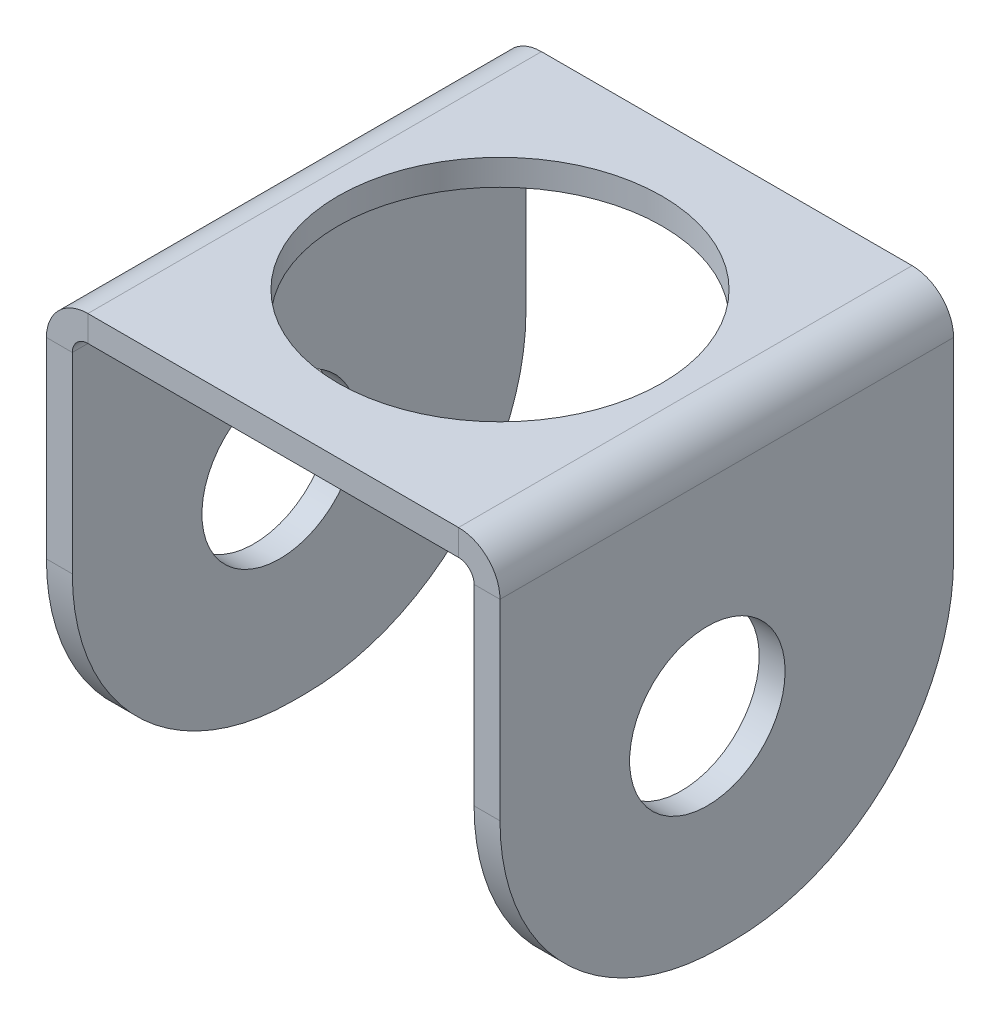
ISO-10303-21;
HEADER;
FILE_DESCRIPTION(('STEP AP214'),'2;1');
FILE_NAME('part.step','',(''),(''),'','','');
FILE_SCHEMA(('AUTOMOTIVE_DESIGN { 1 0 10303 214 1 1 1 1 }'));
ENDSEC;
DATA;
#1=APPLICATION_CONTEXT('core data for automotive mechanical design processes');
#2=APPLICATION_PROTOCOL_DEFINITION('international standard','automotive_design',2000,#1);
#3=PRODUCT_CONTEXT('',#1,'mechanical');
#4=PRODUCT('Part','Part','',(#3));
#5=PRODUCT_RELATED_PRODUCT_CATEGORY('part','',(#4));
#6=PRODUCT_DEFINITION_FORMATION('','',#4);
#7=PRODUCT_DEFINITION_CONTEXT('part definition',#1,'design');
#8=PRODUCT_DEFINITION('design','',#6,#7);
#9=PRODUCT_DEFINITION_SHAPE('','',#8);
#10=(LENGTH_UNIT() NAMED_UNIT(*) SI_UNIT(.MILLI.,.METRE.));
#11=(NAMED_UNIT(*) PLANE_ANGLE_UNIT() SI_UNIT($,.RADIAN.));
#12=(NAMED_UNIT(*) SI_UNIT($,.STERADIAN.) SOLID_ANGLE_UNIT());
#13=UNCERTAINTY_MEASURE_WITH_UNIT(LENGTH_MEASURE(1.E-05),#10,'distance_accuracy_value','');
#14=(GEOMETRIC_REPRESENTATION_CONTEXT(3) GLOBAL_UNCERTAINTY_ASSIGNED_CONTEXT((#13)) GLOBAL_UNIT_ASSIGNED_CONTEXT((#10,
#11,#12)) REPRESENTATION_CONTEXT('',''));
#15=CARTESIAN_POINT('',(0.,0.,0.));
#16=DIRECTION('',(0.,0.,1.));
#17=DIRECTION('',(1.,0.,0.));
#18=AXIS2_PLACEMENT_3D('',#15,#16,#17);
#19=CARTESIAN_POINT('',(-17.5,-35.,17.5));
#20=DIRECTION('',(-1.,0.,0.));
#21=DIRECTION('',(0.,-1.,0.));
#22=AXIS2_PLACEMENT_3D('',#19,#20,#21);
#23=PLANE('',#22);
#24=DIRECTION('',(0.,0.,1.));
#25=VECTOR('',#24,1.);
#26=CARTESIAN_POINT('',(-17.5,-3.2,17.5));
#27=LINE('',#26,#25);
#28=CARTESIAN_POINT('',(-17.5,-3.20000000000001,-17.5));
#29=VERTEX_POINT('',#28);
#30=CARTESIAN_POINT('',(-17.5,-3.2,17.5));
#31=VERTEX_POINT('',#30);
#32=EDGE_CURVE('E231',#29,#31,#27,.T.);
#33=ORIENTED_EDGE('',*,*,#32,.F.);
#34=DIRECTION('',(0.,1.,0.));
#35=VECTOR('',#34,1.);
#36=CARTESIAN_POINT('',(-17.5,-35.,-17.5));
#37=LINE('',#36,#35);
#38=CARTESIAN_POINT('',(-17.5,-18.,-17.5));
#39=VERTEX_POINT('',#38);
#40=EDGE_CURVE('E223',#39,#29,#37,.T.);
#41=ORIENTED_EDGE('',*,*,#40,.F.);
#42=CARTESIAN_POINT('',(-17.5,-18.,-0.5));
#43=DIRECTION('',(-1.,0.,0.));
#44=DIRECTION('',(0.,-1.,0.));
#45=AXIS2_PLACEMENT_3D('',#42,#43,#44);
#46=CIRCLE('',#45,17.);
#47=CARTESIAN_POINT('',(-17.5,-35.,-0.5));
#48=VERTEX_POINT('',#47);
#49=EDGE_CURVE('E226',#39,#48,#46,.T.);
#50=ORIENTED_EDGE('',*,*,#49,.T.);
#51=DIRECTION('',(0.,0.,-1.));
#52=VECTOR('',#51,1.);
#53=CARTESIAN_POINT('',(-17.5,-35.,17.5));
#54=LINE('',#53,#52);
#55=CARTESIAN_POINT('',(-17.5,-35.,0.5));
#56=VERTEX_POINT('',#55);
#57=EDGE_CURVE('E219',#56,#48,#54,.T.);
#58=ORIENTED_EDGE('',*,*,#57,.F.);
#59=CARTESIAN_POINT('',(-17.5,-18.,0.5));
#60=DIRECTION('',(-1.,0.,0.));
#61=DIRECTION('',(0.,-1.,0.));
#62=AXIS2_PLACEMENT_3D('',#59,#60,#61);
#63=CIRCLE('',#62,17.);
#64=CARTESIAN_POINT('',(-17.5,-18.,17.5));
#65=VERTEX_POINT('',#64);
#66=EDGE_CURVE('E49',#56,#65,#63,.T.);
#67=ORIENTED_EDGE('',*,*,#66,.T.);
#68=DIRECTION('',(0.,1.,0.));
#69=VECTOR('',#68,1.);
#70=CARTESIAN_POINT('',(-17.5,-35.,17.5));
#71=LINE('',#70,#69);
#72=EDGE_CURVE('E42',#65,#31,#71,.T.);
#73=ORIENTED_EDGE('',*,*,#72,.T.);
#74=EDGE_LOOP('',(#33,#41,#50,#58,#67,#73));
#75=FACE_BOUND('',#74,.T.);
#76=CARTESIAN_POINT('',(-17.5,-19.,1.5));
#77=DIRECTION('',(1.,0.,0.));
#78=DIRECTION('',(0.,0.,-1.));
#79=AXIS2_PLACEMENT_3D('',#76,#77,#78);
#80=CIRCLE('',#79,6.);
#81=CARTESIAN_POINT('',(-17.5,-19.,-4.5));
#82=VERTEX_POINT('',#81);
#83=EDGE_CURVE('E216',#82,#82,#80,.T.);
#84=ORIENTED_EDGE('',*,*,#83,.T.);
#85=EDGE_LOOP('',(#84));
#86=FACE_BOUND('',#85,.T.);
#87=ADVANCED_FACE('F28',(#75,#86),#23,.T.);
#88=CARTESIAN_POINT('',(-17.5,-19.,1.5));
#89=DIRECTION('',(1.,0.,0.));
#90=DIRECTION('',(0.,0.,-1.));
#91=AXIS2_PLACEMENT_3D('',#88,#89,#90);
#92=CYLINDRICAL_SURFACE('',#91,6.);
#93=ORIENTED_EDGE('',*,*,#83,.F.);
#94=EDGE_LOOP('',(#93));
#95=FACE_BOUND('',#94,.T.);
#96=CARTESIAN_POINT('',(-15.5,-19.,1.5));
#97=DIRECTION('',(-1.,0.,0.));
#98=DIRECTION('',(0.,-1.,0.));
#99=AXIS2_PLACEMENT_3D('',#96,#97,#98);
#100=CIRCLE('',#99,6.);
#101=CARTESIAN_POINT('',(-15.5,-25.,1.5));
#102=VERTEX_POINT('',#101);
#103=EDGE_CURVE('E201',#102,#102,#100,.T.);
#104=ORIENTED_EDGE('',*,*,#103,.F.);
#105=EDGE_LOOP('',(#104));
#106=FACE_BOUND('',#105,.T.);
#107=ADVANCED_FACE('F359',(#95,#106),#92,.F.);
#108=CARTESIAN_POINT('',(-15.5,-35.,17.5));
#109=DIRECTION('',(-1.,0.,0.));
#110=DIRECTION('',(0.,-1.,0.));
#111=AXIS2_PLACEMENT_3D('',#108,#109,#110);
#112=PLANE('',#111);
#113=ORIENTED_EDGE('',*,*,#103,.T.);
#114=EDGE_LOOP('',(#113));
#115=FACE_BOUND('',#114,.T.);
#116=DIRECTION('',(0.,1.,0.));
#117=VECTOR('',#116,1.);
#118=CARTESIAN_POINT('',(-15.5,-35.,-17.5));
#119=LINE('',#118,#117);
#120=CARTESIAN_POINT('',(-15.5,-18.,-17.5));
#121=VERTEX_POINT('',#120);
#122=CARTESIAN_POINT('',(-15.5,-3.2,-17.5));
#123=VERTEX_POINT('',#122);
#124=EDGE_CURVE('E213',#121,#123,#119,.T.);
#125=ORIENTED_EDGE('',*,*,#124,.T.);
#126=DIRECTION('',(0.,0.,1.));
#127=VECTOR('',#126,1.);
#128=CARTESIAN_POINT('',(-15.5,-3.2,17.5));
#129=LINE('',#128,#127);
#130=CARTESIAN_POINT('',(-15.5,-3.19999999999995,17.5));
#131=VERTEX_POINT('',#130);
#132=EDGE_CURVE('E229',#123,#131,#129,.T.);
#133=ORIENTED_EDGE('',*,*,#132,.T.);
#134=DIRECTION('',(0.,1.,0.));
#135=VECTOR('',#134,1.);
#136=CARTESIAN_POINT('',(-15.5,-35.,17.5));
#137=LINE('',#136,#135);
#138=CARTESIAN_POINT('',(-15.5,-18.,17.5));
#139=VERTEX_POINT('',#138);
#140=EDGE_CURVE('E204',#139,#131,#137,.T.);
#141=ORIENTED_EDGE('',*,*,#140,.F.);
#142=CARTESIAN_POINT('',(-15.5,-18.,0.5));
#143=DIRECTION('',(-1.,0.,0.));
#144=DIRECTION('',(0.,-1.,0.));
#145=AXIS2_PLACEMENT_3D('',#142,#143,#144);
#146=CIRCLE('',#145,17.);
#147=CARTESIAN_POINT('',(-15.5,-35.,0.5));
#148=VERTEX_POINT('',#147);
#149=EDGE_CURVE('E207',#139,#148,#146,.F.);
#150=ORIENTED_EDGE('',*,*,#149,.T.);
#151=DIRECTION('',(0.,0.,-1.));
#152=VECTOR('',#151,1.);
#153=CARTESIAN_POINT('',(-15.5,-35.,17.5));
#154=LINE('',#153,#152);
#155=CARTESIAN_POINT('',(-15.5,-35.,-0.5));
#156=VERTEX_POINT('',#155);
#157=EDGE_CURVE('E209',#148,#156,#154,.T.);
#158=ORIENTED_EDGE('',*,*,#157,.T.);
#159=CARTESIAN_POINT('',(-15.5,-18.,-0.5));
#160=DIRECTION('',(-1.,0.,0.));
#161=DIRECTION('',(0.,-1.,0.));
#162=AXIS2_PLACEMENT_3D('',#159,#160,#161);
#163=CIRCLE('',#162,17.);
#164=EDGE_CURVE('E211',#156,#121,#163,.F.);
#165=ORIENTED_EDGE('',*,*,#164,.T.);
#166=EDGE_LOOP('',(#125,#133,#141,#150,#158,#165));
#167=FACE_BOUND('',#166,.T.);
#168=ADVANCED_FACE('F260',(#115,#167),#112,.F.);
#169=CARTESIAN_POINT('',(77.0777986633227,-35.,17.5));
#170=DIRECTION('',(0.,0.,1.));
#171=DIRECTION('',(-1.,0.,0.));
#172=AXIS2_PLACEMENT_3D('',#169,#170,#171);
#173=PLANE('',#172);
#174=DIRECTION('',(-1.,0.,0.));
#175=VECTOR('',#174,1.);
#176=CARTESIAN_POINT('',(77.0777986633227,-3.19999999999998,17.5));
#177=LINE('',#176,#175);
#178=EDGE_CURVE('E11',#131,#31,#177,.T.);
#179=ORIENTED_EDGE('',*,*,#178,.T.);
#180=ORIENTED_EDGE('',*,*,#72,.F.);
#181=DIRECTION('',(-1.,0.,0.));
#182=VECTOR('',#181,1.);
#183=CARTESIAN_POINT('',(77.0777986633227,-18.,17.5));
#184=LINE('',#183,#182);
#185=EDGE_CURVE('E36',#139,#65,#184,.T.);
#186=ORIENTED_EDGE('',*,*,#185,.F.);
#187=ORIENTED_EDGE('',*,*,#140,.T.);
#188=EDGE_LOOP('',(#179,#180,#186,#187));
#189=FACE_BOUND('',#188,.T.);
#190=ADVANCED_FACE('F30',(#189),#173,.T.);
#191=CARTESIAN_POINT('',(77.0777986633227,-18.,0.5));
#192=DIRECTION('',(-1.,0.,0.));
#193=DIRECTION('',(0.,-1.,0.));
#194=AXIS2_PLACEMENT_3D('',#191,#192,#193);
#195=CYLINDRICAL_SURFACE('',#194,17.);
#196=ORIENTED_EDGE('',*,*,#66,.F.);
#197=DIRECTION('',(-1.,0.,0.));
#198=VECTOR('',#197,1.);
#199=CARTESIAN_POINT('',(77.0777986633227,-35.,0.5));
#200=LINE('',#199,#198);
#201=EDGE_CURVE('E241',#148,#56,#200,.T.);
#202=ORIENTED_EDGE('',*,*,#201,.F.);
#203=ORIENTED_EDGE('',*,*,#149,.F.);
#204=ORIENTED_EDGE('',*,*,#185,.T.);
#205=EDGE_LOOP('',(#196,#202,#203,#204));
#206=FACE_BOUND('',#205,.T.);
#207=ADVANCED_FACE('F243',(#206),#195,.T.);
#208=CARTESIAN_POINT('',(77.0777986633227,-35.,17.5));
#209=DIRECTION('',(0.,1.,0.));
#210=DIRECTION('',(-1.,0.,0.));
#211=AXIS2_PLACEMENT_3D('',#208,#209,#210);
#212=PLANE('',#211);
#213=ORIENTED_EDGE('',*,*,#57,.T.);
#214=DIRECTION('',(-1.,0.,0.));
#215=VECTOR('',#214,1.);
#216=CARTESIAN_POINT('',(77.0777986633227,-35.,-0.5));
#217=LINE('',#216,#215);
#218=EDGE_CURVE('E238',#156,#48,#217,.T.);
#219=ORIENTED_EDGE('',*,*,#218,.F.);
#220=ORIENTED_EDGE('',*,*,#157,.F.);
#221=ORIENTED_EDGE('',*,*,#201,.T.);
#222=EDGE_LOOP('',(#213,#219,#220,#221));
#223=FACE_BOUND('',#222,.T.);
#224=ADVANCED_FACE('F252',(#223),#212,.F.);
#225=CARTESIAN_POINT('',(77.0777986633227,-18.,-0.5));
#226=DIRECTION('',(-1.,0.,0.));
#227=DIRECTION('',(0.,-1.,0.));
#228=AXIS2_PLACEMENT_3D('',#225,#226,#227);
#229=CYLINDRICAL_SURFACE('',#228,17.);
#230=ORIENTED_EDGE('',*,*,#49,.F.);
#231=DIRECTION('',(-1.,0.,0.));
#232=VECTOR('',#231,1.);
#233=CARTESIAN_POINT('',(77.0777986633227,-18.,-17.5));
#234=LINE('',#233,#232);
#235=EDGE_CURVE('E236',#121,#39,#234,.T.);
#236=ORIENTED_EDGE('',*,*,#235,.F.);
#237=ORIENTED_EDGE('',*,*,#164,.F.);
#238=ORIENTED_EDGE('',*,*,#218,.T.);
#239=EDGE_LOOP('',(#230,#236,#237,#238));
#240=FACE_BOUND('',#239,.T.);
#241=ADVANCED_FACE('F256',(#240),#229,.T.);
#242=CARTESIAN_POINT('',(77.0777986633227,-35.,-17.5));
#243=DIRECTION('',(0.,0.,1.));
#244=DIRECTION('',(-1.,0.,0.));
#245=AXIS2_PLACEMENT_3D('',#242,#243,#244);
#246=PLANE('',#245);
#247=ORIENTED_EDGE('',*,*,#40,.T.);
#248=DIRECTION('',(-1.,0.,0.));
#249=VECTOR('',#248,1.);
#250=CARTESIAN_POINT('',(77.0777986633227,-3.19999999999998,-17.5));
#251=LINE('',#250,#249);
#252=EDGE_CURVE('E234',#123,#29,#251,.T.);
#253=ORIENTED_EDGE('',*,*,#252,.F.);
#254=ORIENTED_EDGE('',*,*,#124,.F.);
#255=ORIENTED_EDGE('',*,*,#235,.T.);
#256=EDGE_LOOP('',(#247,#253,#254,#255));
#257=FACE_BOUND('',#256,.T.);
#258=ADVANCED_FACE('F263',(#257),#246,.F.);
#259=CARTESIAN_POINT('',(-17.5,0.,17.5));
#260=DIRECTION('',(0.,1.,0.));
#261=DIRECTION('',(-1.,0.,0.));
#262=AXIS2_PLACEMENT_3D('',#259,#260,#261);
#263=PLANE('',#262);
#264=CARTESIAN_POINT('',(0.,0.,0.));
#265=DIRECTION('',(0.,1.,0.));
#266=DIRECTION('',(-1.,0.,0.));
#267=AXIS2_PLACEMENT_3D('',#264,#265,#266);
#268=CIRCLE('',#267,12.5);
#269=CARTESIAN_POINT('',(-12.5,0.,0.));
#270=VERTEX_POINT('',#269);
#271=EDGE_CURVE('E177',#270,#270,#268,.T.);
#272=ORIENTED_EDGE('',*,*,#271,.F.);
#273=EDGE_LOOP('',(#272));
#274=FACE_BOUND('',#273,.T.);
#275=DIRECTION('',(1.,0.,0.));
#276=VECTOR('',#275,1.);
#277=CARTESIAN_POINT('',(-17.5,0.,-17.5));
#278=LINE('',#277,#276);
#279=CARTESIAN_POINT('',(-14.3,0.,-17.5));
#280=VERTEX_POINT('',#279);
#281=CARTESIAN_POINT('',(14.3,0.,-17.5));
#282=VERTEX_POINT('',#281);
#283=EDGE_CURVE('E181',#280,#282,#278,.T.);
#284=ORIENTED_EDGE('',*,*,#283,.F.);
#285=DIRECTION('',(0.,0.,1.));
#286=VECTOR('',#285,1.);
#287=CARTESIAN_POINT('',(-14.3,0.,17.5));
#288=LINE('',#287,#286);
#289=CARTESIAN_POINT('',(-14.3,0.,17.5));
#290=VERTEX_POINT('',#289);
#291=EDGE_CURVE('E161',#280,#290,#288,.T.);
#292=ORIENTED_EDGE('',*,*,#291,.T.);
#293=DIRECTION('',(1.,0.,0.));
#294=VECTOR('',#293,1.);
#295=CARTESIAN_POINT('',(-17.5,0.,17.5));
#296=LINE('',#295,#294);
#297=CARTESIAN_POINT('',(14.3,0.,17.5));
#298=VERTEX_POINT('',#297);
#299=EDGE_CURVE('E162',#290,#298,#296,.T.);
#300=ORIENTED_EDGE('',*,*,#299,.T.);
#301=DIRECTION('',(0.,0.,1.));
#302=VECTOR('',#301,1.);
#303=CARTESIAN_POINT('',(14.3,0.,17.5));
#304=LINE('',#303,#302);
#305=EDGE_CURVE('E198',#282,#298,#304,.T.);
#306=ORIENTED_EDGE('',*,*,#305,.F.);
#307=EDGE_LOOP('',(#284,#292,#300,#306));
#308=FACE_BOUND('',#307,.T.);
#309=ADVANCED_FACE('F355',(#274,#308),#263,.T.);
#310=CARTESIAN_POINT('',(-17.5,-2.,17.5));
#311=DIRECTION('',(0.,1.,0.));
#312=DIRECTION('',(-1.,0.,0.));
#313=AXIS2_PLACEMENT_3D('',#310,#311,#312);
#314=PLANE('',#313);
#315=CARTESIAN_POINT('',(0.,-2.,0.));
#316=DIRECTION('',(0.,1.,0.));
#317=DIRECTION('',(-1.,0.,0.));
#318=AXIS2_PLACEMENT_3D('',#315,#316,#317);
#319=CIRCLE('',#318,12.5);
#320=CARTESIAN_POINT('',(-12.5,-2.,0.));
#321=VERTEX_POINT('',#320);
#322=EDGE_CURVE('E183',#321,#321,#319,.T.);
#323=ORIENTED_EDGE('',*,*,#322,.T.);
#324=EDGE_LOOP('',(#323));
#325=FACE_BOUND('',#324,.T.);
#326=DIRECTION('',(0.,0.,1.));
#327=VECTOR('',#326,1.);
#328=CARTESIAN_POINT('',(-14.3,-2.00000000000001,17.5));
#329=LINE('',#328,#327);
#330=CARTESIAN_POINT('',(-14.3,-2.,-17.5));
#331=VERTEX_POINT('',#330);
#332=CARTESIAN_POINT('',(-14.3,-2.,17.5));
#333=VERTEX_POINT('',#332);
#334=EDGE_CURVE('E154',#331,#333,#329,.T.);
#335=ORIENTED_EDGE('',*,*,#334,.F.);
#336=DIRECTION('',(1.,0.,0.));
#337=VECTOR('',#336,1.);
#338=CARTESIAN_POINT('',(-17.5,-2.,-17.5));
#339=LINE('',#338,#337);
#340=CARTESIAN_POINT('',(14.3,-1.99999999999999,-17.5));
#341=VERTEX_POINT('',#340);
#342=EDGE_CURVE('E178',#331,#341,#339,.T.);
#343=ORIENTED_EDGE('',*,*,#342,.T.);
#344=DIRECTION('',(0.,0.,1.));
#345=VECTOR('',#344,1.);
#346=CARTESIAN_POINT('',(14.3,-1.99999999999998,17.5));
#347=LINE('',#346,#345);
#348=CARTESIAN_POINT('',(14.3,-1.99999999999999,17.5));
#349=VERTEX_POINT('',#348);
#350=EDGE_CURVE('E173',#341,#349,#347,.T.);
#351=ORIENTED_EDGE('',*,*,#350,.T.);
#352=DIRECTION('',(1.,0.,0.));
#353=VECTOR('',#352,1.);
#354=CARTESIAN_POINT('',(-17.5,-2.,17.5));
#355=LINE('',#354,#353);
#356=EDGE_CURVE('E169',#333,#349,#355,.T.);
#357=ORIENTED_EDGE('',*,*,#356,.F.);
#358=EDGE_LOOP('',(#335,#343,#351,#357));
#359=FACE_BOUND('',#358,.T.);
#360=ADVANCED_FACE('F176',(#325,#359),#314,.F.);
#361=CARTESIAN_POINT('',(0.,-35.,0.));
#362=DIRECTION('',(0.,1.,0.));
#363=DIRECTION('',(-1.,0.,0.));
#364=AXIS2_PLACEMENT_3D('',#361,#362,#363);
#365=CYLINDRICAL_SURFACE('',#364,12.5);
#366=ORIENTED_EDGE('',*,*,#271,.T.);
#367=EDGE_LOOP('',(#366));
#368=FACE_BOUND('',#367,.T.);
#369=ORIENTED_EDGE('',*,*,#322,.F.);
#370=EDGE_LOOP('',(#369));
#371=FACE_BOUND('',#370,.T.);
#372=ADVANCED_FACE('F345',(#368,#371),#365,.F.);
#373=CARTESIAN_POINT('',(-17.5,-90.398230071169,17.5));
#374=DIRECTION('',(0.,0.,1.));
#375=DIRECTION('',(0.,1.,0.));
#376=AXIS2_PLACEMENT_3D('',#373,#374,#375);
#377=PLANE('',#376);
#378=DIRECTION('',(0.,1.,0.));
#379=VECTOR('',#378,1.);
#380=CARTESIAN_POINT('',(14.3,-90.398230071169,17.5));
#381=LINE('',#380,#379);
#382=EDGE_CURVE('E191',#349,#298,#381,.T.);
#383=ORIENTED_EDGE('',*,*,#382,.T.);
#384=ORIENTED_EDGE('',*,*,#299,.F.);
#385=DIRECTION('',(0.,1.,0.));
#386=VECTOR('',#385,1.);
#387=CARTESIAN_POINT('',(-14.3,-90.398230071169,17.5));
#388=LINE('',#387,#386);
#389=EDGE_CURVE('E146',#333,#290,#388,.T.);
#390=ORIENTED_EDGE('',*,*,#389,.F.);
#391=ORIENTED_EDGE('',*,*,#356,.T.);
#392=EDGE_LOOP('',(#383,#384,#390,#391));
#393=FACE_BOUND('',#392,.T.);
#394=ADVANCED_FACE('F168',(#393),#377,.T.);
#395=CARTESIAN_POINT('',(-17.5,-90.398230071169,-17.5));
#396=DIRECTION('',(0.,0.,1.));
#397=DIRECTION('',(0.,1.,0.));
#398=AXIS2_PLACEMENT_3D('',#395,#396,#397);
#399=PLANE('',#398);
#400=ORIENTED_EDGE('',*,*,#283,.T.);
#401=DIRECTION('',(0.,1.,0.));
#402=VECTOR('',#401,1.);
#403=CARTESIAN_POINT('',(14.3,-90.398230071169,-17.5));
#404=LINE('',#403,#402);
#405=EDGE_CURVE('E193',#341,#282,#404,.T.);
#406=ORIENTED_EDGE('',*,*,#405,.F.);
#407=ORIENTED_EDGE('',*,*,#342,.F.);
#408=DIRECTION('',(0.,1.,0.));
#409=VECTOR('',#408,1.);
#410=CARTESIAN_POINT('',(-14.3,-90.398230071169,-17.5));
#411=LINE('',#410,#409);
#412=EDGE_CURVE('E174',#331,#280,#411,.T.);
#413=ORIENTED_EDGE('',*,*,#412,.T.);
#414=EDGE_LOOP('',(#400,#406,#407,#413));
#415=FACE_BOUND('',#414,.T.);
#416=ADVANCED_FACE('F353',(#415),#399,.F.);
#417=CARTESIAN_POINT('',(17.5,0.,17.5));
#418=DIRECTION('',(1.,0.,0.));
#419=DIRECTION('',(0.,1.,0.));
#420=AXIS2_PLACEMENT_3D('',#417,#418,#419);
#421=PLANE('',#420);
#422=CARTESIAN_POINT('',(17.5,-19.,1.5));
#423=DIRECTION('',(1.,0.,0.));
#424=DIRECTION('',(0.,0.,-1.));
#425=AXIS2_PLACEMENT_3D('',#422,#423,#424);
#426=CIRCLE('',#425,6.);
#427=CARTESIAN_POINT('',(17.5,-19.,-4.5));
#428=VERTEX_POINT('',#427);
#429=EDGE_CURVE('E303',#428,#428,#426,.T.);
#430=ORIENTED_EDGE('',*,*,#429,.F.);
#431=EDGE_LOOP('',(#430));
#432=FACE_BOUND('',#431,.T.);
#433=DIRECTION('',(0.,-1.,0.));
#434=VECTOR('',#433,1.);
#435=CARTESIAN_POINT('',(17.5,0.,-17.5));
#436=LINE('',#435,#434);
#437=CARTESIAN_POINT('',(17.5,-3.19999999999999,-17.5));
#438=VERTEX_POINT('',#437);
#439=CARTESIAN_POINT('',(17.5,-18.,-17.5));
#440=VERTEX_POINT('',#439);
#441=EDGE_CURVE('E318',#438,#440,#436,.T.);
#442=ORIENTED_EDGE('',*,*,#441,.F.);
#443=DIRECTION('',(0.,0.,1.));
#444=VECTOR('',#443,1.);
#445=CARTESIAN_POINT('',(17.5,-3.19999999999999,17.5));
#446=LINE('',#445,#444);
#447=CARTESIAN_POINT('',(17.5,-3.19999999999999,17.5));
#448=VERTEX_POINT('',#447);
#449=EDGE_CURVE('E323',#438,#448,#446,.T.);
#450=ORIENTED_EDGE('',*,*,#449,.T.);
#451=DIRECTION('',(0.,-1.,0.));
#452=VECTOR('',#451,1.);
#453=CARTESIAN_POINT('',(17.5,0.,17.5));
#454=LINE('',#453,#452);
#455=CARTESIAN_POINT('',(17.5,-18.,17.5));
#456=VERTEX_POINT('',#455);
#457=EDGE_CURVE('E306',#448,#456,#454,.T.);
#458=ORIENTED_EDGE('',*,*,#457,.T.);
#459=CARTESIAN_POINT('',(17.5,-18.,0.5));
#460=DIRECTION('',(1.,0.,0.));
#461=DIRECTION('',(0.,1.,0.));
#462=AXIS2_PLACEMENT_3D('',#459,#460,#461);
#463=CIRCLE('',#462,17.);
#464=CARTESIAN_POINT('',(17.5,-35.,0.5));
#465=VERTEX_POINT('',#464);
#466=EDGE_CURVE('E309',#456,#465,#463,.T.);
#467=ORIENTED_EDGE('',*,*,#466,.T.);
#468=DIRECTION('',(0.,0.,-1.));
#469=VECTOR('',#468,1.);
#470=CARTESIAN_POINT('',(17.5,-35.,17.5));
#471=LINE('',#470,#469);
#472=CARTESIAN_POINT('',(17.5,-35.,-0.5));
#473=VERTEX_POINT('',#472);
#474=EDGE_CURVE('E312',#465,#473,#471,.T.);
#475=ORIENTED_EDGE('',*,*,#474,.T.);
#476=CARTESIAN_POINT('',(17.5,-18.,-0.5));
#477=DIRECTION('',(1.,0.,0.));
#478=DIRECTION('',(0.,1.,0.));
#479=AXIS2_PLACEMENT_3D('',#476,#477,#478);
#480=CIRCLE('',#479,17.);
#481=EDGE_CURVE('E315',#473,#440,#480,.T.);
#482=ORIENTED_EDGE('',*,*,#481,.T.);
#483=EDGE_LOOP('',(#442,#450,#458,#467,#475,#482));
#484=FACE_BOUND('',#483,.T.);
#485=ADVANCED_FACE('F418',(#432,#484),#421,.T.);
#486=CARTESIAN_POINT('',(15.5,0.,17.5));
#487=DIRECTION('',(1.,0.,0.));
#488=DIRECTION('',(0.,1.,0.));
#489=AXIS2_PLACEMENT_3D('',#486,#487,#488);
#490=PLANE('',#489);
#491=CARTESIAN_POINT('',(15.5,-19.,1.5));
#492=DIRECTION('',(1.,0.,0.));
#493=DIRECTION('',(0.,1.,0.));
#494=AXIS2_PLACEMENT_3D('',#491,#492,#493);
#495=CIRCLE('',#494,6.);
#496=CARTESIAN_POINT('',(15.5,-13.,1.5));
#497=VERTEX_POINT('',#496);
#498=EDGE_CURVE('E288',#497,#497,#495,.T.);
#499=ORIENTED_EDGE('',*,*,#498,.T.);
#500=EDGE_LOOP('',(#499));
#501=FACE_BOUND('',#500,.T.);
#502=DIRECTION('',(0.,0.,1.));
#503=VECTOR('',#502,1.);
#504=CARTESIAN_POINT('',(15.5,-3.19999999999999,17.5));
#505=LINE('',#504,#503);
#506=CARTESIAN_POINT('',(15.5,-3.19999999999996,-17.5));
#507=VERTEX_POINT('',#506);
#508=CARTESIAN_POINT('',(15.5,-3.19999999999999,17.5));
#509=VERTEX_POINT('',#508);
#510=EDGE_CURVE('E320',#507,#509,#505,.T.);
#511=ORIENTED_EDGE('',*,*,#510,.F.);
#512=DIRECTION('',(0.,-1.,0.));
#513=VECTOR('',#512,1.);
#514=CARTESIAN_POINT('',(15.5,0.,-17.5));
#515=LINE('',#514,#513);
#516=CARTESIAN_POINT('',(15.5,-18.,-17.5));
#517=VERTEX_POINT('',#516);
#518=EDGE_CURVE('E299',#507,#517,#515,.T.);
#519=ORIENTED_EDGE('',*,*,#518,.T.);
#520=CARTESIAN_POINT('',(15.5,-18.,-0.5));
#521=DIRECTION('',(1.,0.,0.));
#522=DIRECTION('',(0.,1.,0.));
#523=AXIS2_PLACEMENT_3D('',#520,#521,#522);
#524=CIRCLE('',#523,17.);
#525=CARTESIAN_POINT('',(15.5,-35.,-0.5));
#526=VERTEX_POINT('',#525);
#527=EDGE_CURVE('E301',#517,#526,#524,.F.);
#528=ORIENTED_EDGE('',*,*,#527,.T.);
#529=DIRECTION('',(0.,0.,-1.));
#530=VECTOR('',#529,1.);
#531=CARTESIAN_POINT('',(15.5,-35.,17.5));
#532=LINE('',#531,#530);
#533=CARTESIAN_POINT('',(15.5,-35.,0.5));
#534=VERTEX_POINT('',#533);
#535=EDGE_CURVE('E291',#534,#526,#532,.T.);
#536=ORIENTED_EDGE('',*,*,#535,.F.);
#537=CARTESIAN_POINT('',(15.5,-18.,0.5));
#538=DIRECTION('',(1.,0.,0.));
#539=DIRECTION('',(0.,1.,0.));
#540=AXIS2_PLACEMENT_3D('',#537,#538,#539);
#541=CIRCLE('',#540,17.);
#542=CARTESIAN_POINT('',(15.5,-18.,17.5));
#543=VERTEX_POINT('',#542);
#544=EDGE_CURVE('E294',#534,#543,#541,.F.);
#545=ORIENTED_EDGE('',*,*,#544,.T.);
#546=DIRECTION('',(0.,-1.,0.));
#547=VECTOR('',#546,1.);
#548=CARTESIAN_POINT('',(15.5,0.,17.5));
#549=LINE('',#548,#547);
#550=EDGE_CURVE('E296',#509,#543,#549,.T.);
#551=ORIENTED_EDGE('',*,*,#550,.F.);
#552=EDGE_LOOP('',(#511,#519,#528,#536,#545,#551));
#553=FACE_BOUND('',#552,.T.);
#554=ADVANCED_FACE('F425',(#501,#553),#490,.F.);
#555=CARTESIAN_POINT('',(-17.5,-19.,1.5));
#556=DIRECTION('',(1.,0.,0.));
#557=DIRECTION('',(0.,0.,-1.));
#558=AXIS2_PLACEMENT_3D('',#555,#556,#557);
#559=CYLINDRICAL_SURFACE('',#558,6.);
#560=ORIENTED_EDGE('',*,*,#429,.T.);
#561=EDGE_LOOP('',(#560));
#562=FACE_BOUND('',#561,.T.);
#563=ORIENTED_EDGE('',*,*,#498,.F.);
#564=EDGE_LOOP('',(#563));
#565=FACE_BOUND('',#564,.T.);
#566=ADVANCED_FACE('F433',(#562,#565),#559,.F.);
#567=CARTESIAN_POINT('',(-77.0777986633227,0.,17.5));
#568=DIRECTION('',(0.,0.,1.));
#569=DIRECTION('',(1.,0.,0.));
#570=AXIS2_PLACEMENT_3D('',#567,#568,#569);
#571=PLANE('',#570);
#572=DIRECTION('',(1.,0.,0.));
#573=VECTOR('',#572,1.);
#574=CARTESIAN_POINT('',(-77.0777986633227,-18.,17.5));
#575=LINE('',#574,#573);
#576=EDGE_CURVE('E326',#543,#456,#575,.T.);
#577=ORIENTED_EDGE('',*,*,#576,.T.);
#578=ORIENTED_EDGE('',*,*,#457,.F.);
#579=DIRECTION('',(1.,0.,0.));
#580=VECTOR('',#579,1.);
#581=CARTESIAN_POINT('',(-77.0777986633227,-3.20000000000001,17.5));
#582=LINE('',#581,#580);
#583=EDGE_CURVE('E340',#509,#448,#582,.T.);
#584=ORIENTED_EDGE('',*,*,#583,.F.);
#585=ORIENTED_EDGE('',*,*,#550,.T.);
#586=EDGE_LOOP('',(#577,#578,#584,#585));
#587=FACE_BOUND('',#586,.T.);
#588=ADVANCED_FACE('F441',(#587),#571,.T.);
#589=CARTESIAN_POINT('',(-77.0777986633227,0.,-17.5));
#590=DIRECTION('',(0.,0.,1.));
#591=DIRECTION('',(1.,0.,0.));
#592=AXIS2_PLACEMENT_3D('',#589,#590,#591);
#593=PLANE('',#592);
#594=ORIENTED_EDGE('',*,*,#441,.T.);
#595=DIRECTION('',(1.,0.,0.));
#596=VECTOR('',#595,1.);
#597=CARTESIAN_POINT('',(-77.0777986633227,-18.,-17.5));
#598=LINE('',#597,#596);
#599=EDGE_CURVE('E334',#517,#440,#598,.T.);
#600=ORIENTED_EDGE('',*,*,#599,.F.);
#601=ORIENTED_EDGE('',*,*,#518,.F.);
#602=DIRECTION('',(1.,0.,0.));
#603=VECTOR('',#602,1.);
#604=CARTESIAN_POINT('',(-77.0777986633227,-3.20000000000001,-17.5));
#605=LINE('',#604,#603);
#606=EDGE_CURVE('E337',#507,#438,#605,.T.);
#607=ORIENTED_EDGE('',*,*,#606,.T.);
#608=EDGE_LOOP('',(#594,#600,#601,#607));
#609=FACE_BOUND('',#608,.T.);
#610=ADVANCED_FACE('F449',(#609),#593,.F.);
#611=CARTESIAN_POINT('',(-77.0777986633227,-18.,-0.5));
#612=DIRECTION('',(1.,0.,0.));
#613=DIRECTION('',(0.,1.,0.));
#614=AXIS2_PLACEMENT_3D('',#611,#612,#613);
#615=CYLINDRICAL_SURFACE('',#614,17.);
#616=ORIENTED_EDGE('',*,*,#481,.F.);
#617=DIRECTION('',(1.,0.,0.));
#618=VECTOR('',#617,1.);
#619=CARTESIAN_POINT('',(-77.0777986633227,-35.,-0.5));
#620=LINE('',#619,#618);
#621=EDGE_CURVE('E331',#526,#473,#620,.T.);
#622=ORIENTED_EDGE('',*,*,#621,.F.);
#623=ORIENTED_EDGE('',*,*,#527,.F.);
#624=ORIENTED_EDGE('',*,*,#599,.T.);
#625=EDGE_LOOP('',(#616,#622,#623,#624));
#626=FACE_BOUND('',#625,.T.);
#627=ADVANCED_FACE('F457',(#626),#615,.T.);
#628=CARTESIAN_POINT('',(-77.0777986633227,-35.,17.5));
#629=DIRECTION('',(0.,-1.,0.));
#630=DIRECTION('',(1.,0.,0.));
#631=AXIS2_PLACEMENT_3D('',#628,#629,#630);
#632=PLANE('',#631);
#633=ORIENTED_EDGE('',*,*,#621,.T.);
#634=ORIENTED_EDGE('',*,*,#474,.F.);
#635=DIRECTION('',(1.,0.,0.));
#636=VECTOR('',#635,1.);
#637=CARTESIAN_POINT('',(-77.0777986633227,-35.,0.5));
#638=LINE('',#637,#636);
#639=EDGE_CURVE('E329',#534,#465,#638,.T.);
#640=ORIENTED_EDGE('',*,*,#639,.F.);
#641=ORIENTED_EDGE('',*,*,#535,.T.);
#642=EDGE_LOOP('',(#633,#634,#640,#641));
#643=FACE_BOUND('',#642,.T.);
#644=ADVANCED_FACE('F465',(#643),#632,.T.);
#645=CARTESIAN_POINT('',(-77.0777986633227,-18.,0.5));
#646=DIRECTION('',(1.,0.,0.));
#647=DIRECTION('',(0.,1.,0.));
#648=AXIS2_PLACEMENT_3D('',#645,#646,#647);
#649=CYLINDRICAL_SURFACE('',#648,17.);
#650=ORIENTED_EDGE('',*,*,#466,.F.);
#651=ORIENTED_EDGE('',*,*,#576,.F.);
#652=ORIENTED_EDGE('',*,*,#544,.F.);
#653=ORIENTED_EDGE('',*,*,#639,.T.);
#654=EDGE_LOOP('',(#650,#651,#652,#653));
#655=FACE_BOUND('',#654,.T.);
#656=ADVANCED_FACE('F473',(#655),#649,.T.);
#657=CARTESIAN_POINT('',(14.3,-3.19999999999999,17.5));
#658=DIRECTION('',(0.,0.,1.));
#659=DIRECTION('',(1.,0.,0.));
#660=AXIS2_PLACEMENT_3D('',#657,#658,#659);
#661=PLANE('',#660);
#662=ORIENTED_EDGE('',*,*,#382,.F.);
#663=CARTESIAN_POINT('',(14.3,-3.19999999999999,17.5));
#664=DIRECTION('',(0.,0.,-1.));
#665=DIRECTION('',(-1.,0.,0.));
#666=AXIS2_PLACEMENT_3D('',#663,#664,#665);
#667=CIRCLE('',#666,1.2);
#668=EDGE_CURVE('E272',#349,#509,#667,.T.);
#669=ORIENTED_EDGE('',*,*,#668,.T.);
#670=ORIENTED_EDGE('',*,*,#583,.T.);
#671=CARTESIAN_POINT('',(14.3,-3.19999999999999,17.5));
#672=DIRECTION('',(0.,0.,-1.));
#673=DIRECTION('',(-1.,0.,0.));
#674=AXIS2_PLACEMENT_3D('',#671,#672,#673);
#675=CIRCLE('',#674,3.2);
#676=EDGE_CURVE('E282',#298,#448,#675,.T.);
#677=ORIENTED_EDGE('',*,*,#676,.F.);
#678=EDGE_LOOP('',(#662,#669,#670,#677));
#679=FACE_BOUND('',#678,.T.);
#680=ADVANCED_FACE('F481',(#679),#661,.T.);
#681=CARTESIAN_POINT('',(14.3,-3.19999999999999,-17.5));
#682=DIRECTION('',(0.,0.,-1.));
#683=DIRECTION('',(-1.,0.,0.));
#684=AXIS2_PLACEMENT_3D('',#681,#682,#683);
#685=PLANE('',#684);
#686=CARTESIAN_POINT('',(14.3,-3.19999999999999,-17.5));
#687=DIRECTION('',(0.,0.,-1.));
#688=DIRECTION('',(-1.,0.,0.));
#689=AXIS2_PLACEMENT_3D('',#686,#687,#688);
#690=CIRCLE('',#689,1.2);
#691=EDGE_CURVE('E275',#507,#341,#690,.F.);
#692=ORIENTED_EDGE('',*,*,#691,.T.);
#693=ORIENTED_EDGE('',*,*,#405,.T.);
#694=CARTESIAN_POINT('',(14.3,-3.19999999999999,-17.5));
#695=DIRECTION('',(0.,0.,-1.));
#696=DIRECTION('',(-1.,0.,0.));
#697=AXIS2_PLACEMENT_3D('',#694,#695,#696);
#698=CIRCLE('',#697,3.2);
#699=EDGE_CURVE('E285',#438,#282,#698,.F.);
#700=ORIENTED_EDGE('',*,*,#699,.F.);
#701=ORIENTED_EDGE('',*,*,#606,.F.);
#702=EDGE_LOOP('',(#692,#693,#700,#701));
#703=FACE_BOUND('',#702,.T.);
#704=ADVANCED_FACE('F489',(#703),#685,.T.);
#705=CARTESIAN_POINT('',(14.3,-3.19999999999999,118.011889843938));
#706=DIRECTION('',(0.,0.,-1.));
#707=DIRECTION('',(-1.,0.,0.));
#708=AXIS2_PLACEMENT_3D('',#705,#706,#707);
#709=CYLINDRICAL_SURFACE('',#708,3.2);
#710=ORIENTED_EDGE('',*,*,#449,.F.);
#711=ORIENTED_EDGE('',*,*,#699,.T.);
#712=ORIENTED_EDGE('',*,*,#305,.T.);
#713=ORIENTED_EDGE('',*,*,#676,.T.);
#714=EDGE_LOOP('',(#710,#711,#712,#713));
#715=FACE_BOUND('',#714,.T.);
#716=ADVANCED_FACE('F492',(#715),#709,.T.);
#717=CARTESIAN_POINT('',(14.3,-3.19999999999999,118.011889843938));
#718=DIRECTION('',(0.,0.,-1.));
#719=DIRECTION('',(-1.,0.,0.));
#720=AXIS2_PLACEMENT_3D('',#717,#718,#719);
#721=CYLINDRICAL_SURFACE('',#720,1.2);
#722=ORIENTED_EDGE('',*,*,#510,.T.);
#723=ORIENTED_EDGE('',*,*,#668,.F.);
#724=ORIENTED_EDGE('',*,*,#350,.F.);
#725=ORIENTED_EDGE('',*,*,#691,.F.);
#726=EDGE_LOOP('',(#722,#723,#724,#725));
#727=FACE_BOUND('',#726,.T.);
#728=ADVANCED_FACE('F500',(#727),#721,.F.);
#729=CARTESIAN_POINT('',(-14.3,-3.2,17.5));
#730=DIRECTION('',(0.,0.,1.));
#731=DIRECTION('',(1.,0.,0.));
#732=AXIS2_PLACEMENT_3D('',#729,#730,#731);
#733=PLANE('',#732);
#734=ORIENTED_EDGE('',*,*,#178,.F.);
#735=CARTESIAN_POINT('',(-14.3,-3.2,17.5));
#736=DIRECTION('',(0.,0.,-1.));
#737=DIRECTION('',(-1.,0.,0.));
#738=AXIS2_PLACEMENT_3D('',#735,#736,#737);
#739=CIRCLE('',#738,1.2);
#740=EDGE_CURVE('E142',#131,#333,#739,.T.);
#741=ORIENTED_EDGE('',*,*,#740,.T.);
#742=ORIENTED_EDGE('',*,*,#389,.T.);
#743=CARTESIAN_POINT('',(-14.3,-3.2,17.5));
#744=DIRECTION('',(0.,0.,-1.));
#745=DIRECTION('',(-1.,0.,0.));
#746=AXIS2_PLACEMENT_3D('',#743,#744,#745);
#747=CIRCLE('',#746,3.2);
#748=EDGE_CURVE('E273',#31,#290,#747,.T.);
#749=ORIENTED_EDGE('',*,*,#748,.F.);
#750=EDGE_LOOP('',(#734,#741,#742,#749));
#751=FACE_BOUND('',#750,.T.);
#752=ADVANCED_FACE('F144',(#751),#733,.T.);
#753=CARTESIAN_POINT('',(-14.3,-3.2,-17.5));
#754=DIRECTION('',(0.,0.,-1.));
#755=DIRECTION('',(-1.,0.,0.));
#756=AXIS2_PLACEMENT_3D('',#753,#754,#755);
#757=PLANE('',#756);
#758=CARTESIAN_POINT('',(-14.3,-3.2,-17.5));
#759=DIRECTION('',(0.,0.,-1.));
#760=DIRECTION('',(-1.,0.,0.));
#761=AXIS2_PLACEMENT_3D('',#758,#759,#760);
#762=CIRCLE('',#761,1.2);
#763=EDGE_CURVE('E150',#331,#123,#762,.F.);
#764=ORIENTED_EDGE('',*,*,#763,.T.);
#765=ORIENTED_EDGE('',*,*,#252,.T.);
#766=CARTESIAN_POINT('',(-14.3,-3.2,-17.5));
#767=DIRECTION('',(0.,0.,-1.));
#768=DIRECTION('',(-1.,0.,0.));
#769=AXIS2_PLACEMENT_3D('',#766,#767,#768);
#770=CIRCLE('',#769,3.2);
#771=EDGE_CURVE('E267',#280,#29,#770,.F.);
#772=ORIENTED_EDGE('',*,*,#771,.F.);
#773=ORIENTED_EDGE('',*,*,#412,.F.);
#774=EDGE_LOOP('',(#764,#765,#772,#773));
#775=FACE_BOUND('',#774,.T.);
#776=ADVANCED_FACE('F266',(#775),#757,.T.);
#777=CARTESIAN_POINT('',(-14.3,-3.2,98.8827991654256));
#778=DIRECTION('',(0.,0.,-1.));
#779=DIRECTION('',(-1.,0.,0.));
#780=AXIS2_PLACEMENT_3D('',#777,#778,#779);
#781=CYLINDRICAL_SURFACE('',#780,3.2);
#782=ORIENTED_EDGE('',*,*,#291,.F.);
#783=ORIENTED_EDGE('',*,*,#771,.T.);
#784=ORIENTED_EDGE('',*,*,#32,.T.);
#785=ORIENTED_EDGE('',*,*,#748,.T.);
#786=EDGE_LOOP('',(#782,#783,#784,#785));
#787=FACE_BOUND('',#786,.T.);
#788=ADVANCED_FACE('F270',(#787),#781,.T.);
#789=CARTESIAN_POINT('',(-14.3,-3.2,98.8827991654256));
#790=DIRECTION('',(0.,0.,-1.));
#791=DIRECTION('',(-1.,0.,0.));
#792=AXIS2_PLACEMENT_3D('',#789,#790,#791);
#793=CYLINDRICAL_SURFACE('',#792,1.2);
#794=ORIENTED_EDGE('',*,*,#334,.T.);
#795=ORIENTED_EDGE('',*,*,#740,.F.);
#796=ORIENTED_EDGE('',*,*,#132,.F.);
#797=ORIENTED_EDGE('',*,*,#763,.F.);
#798=EDGE_LOOP('',(#794,#795,#796,#797));
#799=FACE_BOUND('',#798,.T.);
#800=ADVANCED_FACE('F155',(#799),#793,.F.);
#801=CLOSED_SHELL('',(#87,#107,#168,#190,#207,#224,#241,#258,#309,#360,#372,#394,#416,#485,#554,
#566,#588,#610,#627,#644,#656,#680,#704,#716,#728,#752,#776,#788,#800));
#802=MANIFOLD_SOLID_BREP('B2',#801);
#803=ADVANCED_BREP_SHAPE_REPRESENTATION('',(#18,#802),#14);
#804=SHAPE_DEFINITION_REPRESENTATION(#9,#803);
ENDSEC;
END-ISO-10303-21;
